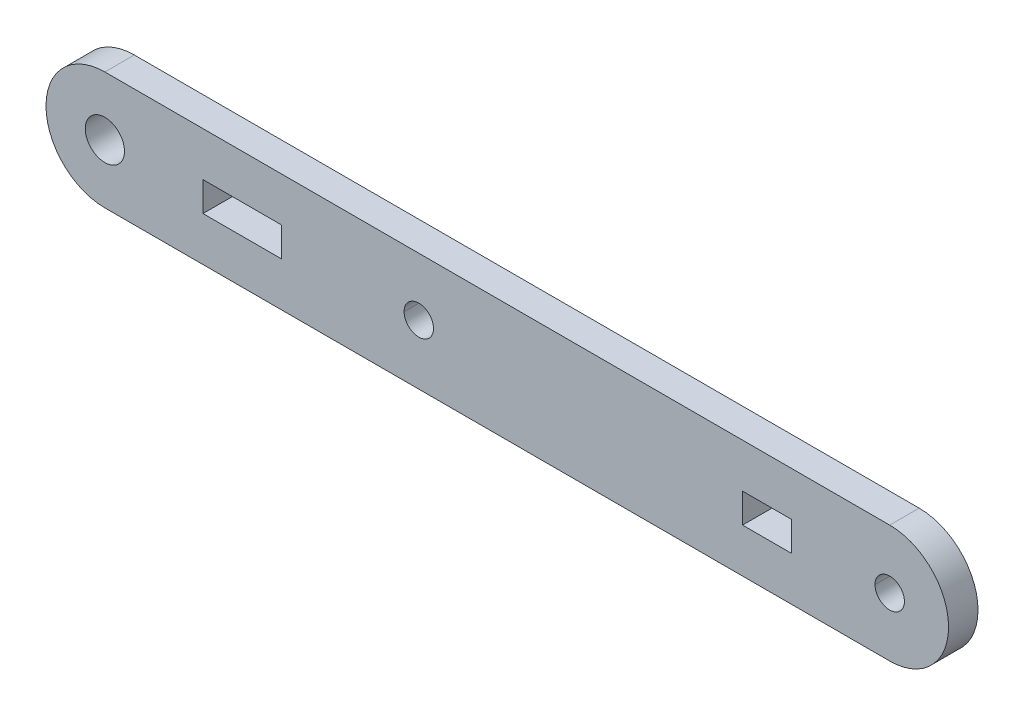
ISO-10303-21;
HEADER;
FILE_DESCRIPTION(('STEP AP214'),'2;1');
FILE_NAME('part.step','',(''),(''),'','','');
FILE_SCHEMA(('AUTOMOTIVE_DESIGN { 1 0 10303 214 1 1 1 1 }'));
ENDSEC;
DATA;
#1=APPLICATION_CONTEXT('core data for automotive mechanical design processes');
#2=APPLICATION_PROTOCOL_DEFINITION('international standard','automotive_design',2000,#1);
#3=PRODUCT_CONTEXT('',#1,'mechanical');
#4=PRODUCT('Part','Part','',(#3));
#5=PRODUCT_RELATED_PRODUCT_CATEGORY('part','',(#4));
#6=PRODUCT_DEFINITION_FORMATION('','',#4);
#7=PRODUCT_DEFINITION_CONTEXT('part definition',#1,'design');
#8=PRODUCT_DEFINITION('design','',#6,#7);
#9=PRODUCT_DEFINITION_SHAPE('','',#8);
#10=(LENGTH_UNIT() NAMED_UNIT(*) SI_UNIT(.MILLI.,.METRE.));
#11=(NAMED_UNIT(*) PLANE_ANGLE_UNIT() SI_UNIT($,.RADIAN.));
#12=(NAMED_UNIT(*) SI_UNIT($,.STERADIAN.) SOLID_ANGLE_UNIT());
#13=UNCERTAINTY_MEASURE_WITH_UNIT(LENGTH_MEASURE(1.E-05),#10,'distance_accuracy_value','');
#14=(GEOMETRIC_REPRESENTATION_CONTEXT(3) GLOBAL_UNCERTAINTY_ASSIGNED_CONTEXT((#13)) GLOBAL_UNIT_ASSIGNED_CONTEXT((#10,
#11,#12)) REPRESENTATION_CONTEXT('',''));
#15=CARTESIAN_POINT('',(0.,0.,0.));
#16=DIRECTION('',(0.,0.,1.));
#17=DIRECTION('',(1.,0.,0.));
#18=AXIS2_PLACEMENT_3D('',#15,#16,#17);
#19=CARTESIAN_POINT('',(-62.9738368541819,-40.5517486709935,0.));
#20=DIRECTION('',(0.,0.,1.));
#21=DIRECTION('',(1.,0.,0.));
#22=AXIS2_PLACEMENT_3D('',#19,#20,#21);
#23=PLANE('',#22);
#24=CARTESIAN_POINT('',(-62.9738368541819,-40.5517486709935,0.));
#25=DIRECTION('',(0.,0.,1.));
#26=DIRECTION('',(1.,0.,0.));
#27=AXIS2_PLACEMENT_3D('',#24,#25,#26);
#28=CIRCLE('',#27,2.);
#29=CARTESIAN_POINT('',(-60.9738368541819,-40.5517486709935,0.));
#30=VERTEX_POINT('',#29);
#31=EDGE_CURVE('E214',#30,#30,#28,.T.);
#32=ORIENTED_EDGE('',*,*,#31,.T.);
#33=EDGE_LOOP('',(#32));
#34=FACE_BOUND('',#33,.T.);
#35=DIRECTION('',(1.,0.,0.));
#36=VECTOR('',#35,1.);
#37=CARTESIAN_POINT('',(2.0261631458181,-42.0517486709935,0.));
#38=LINE('',#37,#36);
#39=CARTESIAN_POINT('',(7.02616314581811,-42.0517486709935,0.));
#40=VERTEX_POINT('',#39);
#41=CARTESIAN_POINT('',(2.0261631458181,-42.0517486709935,0.));
#42=VERTEX_POINT('',#41);
#43=EDGE_CURVE('E246',#40,#42,#38,.F.);
#44=ORIENTED_EDGE('',*,*,#43,.F.);
#45=DIRECTION('',(0.,1.,0.));
#46=VECTOR('',#45,1.);
#47=CARTESIAN_POINT('',(7.0261631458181,-42.0517486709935,0.));
#48=LINE('',#47,#46);
#49=CARTESIAN_POINT('',(7.02616314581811,-39.0517486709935,0.));
#50=VERTEX_POINT('',#49);
#51=EDGE_CURVE('E261',#50,#40,#48,.F.);
#52=ORIENTED_EDGE('',*,*,#51,.F.);
#53=DIRECTION('',(1.,0.,0.));
#54=VECTOR('',#53,1.);
#55=CARTESIAN_POINT('',(2.0261631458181,-39.0517486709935,0.));
#56=LINE('',#55,#54);
#57=CARTESIAN_POINT('',(2.0261631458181,-39.0517486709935,0.));
#58=VERTEX_POINT('',#57);
#59=EDGE_CURVE('E256',#58,#50,#56,.T.);
#60=ORIENTED_EDGE('',*,*,#59,.F.);
#61=DIRECTION('',(0.,1.,0.));
#62=VECTOR('',#61,1.);
#63=CARTESIAN_POINT('',(2.0261631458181,-42.0517486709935,0.));
#64=LINE('',#63,#62);
#65=EDGE_CURVE('E250',#42,#58,#64,.T.);
#66=ORIENTED_EDGE('',*,*,#65,.F.);
#67=EDGE_LOOP('',(#44,#52,#60,#66));
#68=FACE_BOUND('',#67,.T.);
#69=CARTESIAN_POINT('',(17.0261631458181,-40.5517486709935,0.));
#70=DIRECTION('',(0.,0.,-1.));
#71=DIRECTION('',(-1.,0.,0.));
#72=AXIS2_PLACEMENT_3D('',#69,#70,#71);
#73=CIRCLE('',#72,1.5);
#74=CARTESIAN_POINT('',(18.5261631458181,-40.5517486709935,0.));
#75=VERTEX_POINT('',#74);
#76=CARTESIAN_POINT('',(15.5261631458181,-40.5517486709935,0.));
#77=VERTEX_POINT('',#76);
#78=EDGE_CURVE('E179',#75,#77,#73,.F.);
#79=ORIENTED_EDGE('',*,*,#78,.T.);
#80=CARTESIAN_POINT('',(17.0261631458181,-40.5517486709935,0.));
#81=DIRECTION('',(0.,0.,-1.));
#82=DIRECTION('',(-1.,0.,0.));
#83=AXIS2_PLACEMENT_3D('',#80,#81,#82);
#84=CIRCLE('',#83,1.5);
#85=EDGE_CURVE('E177',#77,#75,#84,.F.);
#86=ORIENTED_EDGE('',*,*,#85,.T.);
#87=EDGE_LOOP('',(#79,#86));
#88=FACE_BOUND('',#87,.T.);
#89=DIRECTION('',(1.,0.,0.));
#90=VECTOR('',#89,1.);
#91=CARTESIAN_POINT('',(-62.9738368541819,-34.5517486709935,0.));
#92=LINE('',#91,#90);
#93=CARTESIAN_POINT('',(-62.9738368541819,-34.5517486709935,0.));
#94=VERTEX_POINT('',#93);
#95=CARTESIAN_POINT('',(17.0261631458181,-34.5517486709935,0.));
#96=VERTEX_POINT('',#95);
#97=EDGE_CURVE('E180',#94,#96,#92,.T.);
#98=ORIENTED_EDGE('',*,*,#97,.T.);
#99=CARTESIAN_POINT('',(17.0261631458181,-40.5517486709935,0.));
#100=DIRECTION('',(0.,0.,-1.));
#101=DIRECTION('',(-1.,0.,0.));
#102=AXIS2_PLACEMENT_3D('',#99,#100,#101);
#103=CIRCLE('',#102,6.);
#104=CARTESIAN_POINT('',(17.0261631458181,-46.5517486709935,0.));
#105=VERTEX_POINT('',#104);
#106=EDGE_CURVE('E173',#105,#96,#103,.F.);
#107=ORIENTED_EDGE('',*,*,#106,.F.);
#108=DIRECTION('',(1.,0.,0.));
#109=VECTOR('',#108,1.);
#110=CARTESIAN_POINT('',(-62.9738368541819,-46.5517486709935,0.));
#111=LINE('',#110,#109);
#112=CARTESIAN_POINT('',(-62.9738368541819,-46.5517486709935,0.));
#113=VERTEX_POINT('',#112);
#114=EDGE_CURVE('E176',#105,#113,#111,.F.);
#115=ORIENTED_EDGE('',*,*,#114,.T.);
#116=CARTESIAN_POINT('',(-62.9738368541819,-40.5517486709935,0.));
#117=DIRECTION('',(0.,0.,-1.));
#118=DIRECTION('',(-1.,0.,0.));
#119=AXIS2_PLACEMENT_3D('',#116,#117,#118);
#120=CIRCLE('',#119,6.00000000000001);
#121=CARTESIAN_POINT('',(-68.9738368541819,-40.5517486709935,0.));
#122=VERTEX_POINT('',#121);
#123=EDGE_CURVE('E170',#122,#113,#120,.F.);
#124=ORIENTED_EDGE('',*,*,#123,.F.);
#125=CARTESIAN_POINT('',(-62.9738368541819,-40.5517486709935,0.));
#126=DIRECTION('',(0.,0.,-1.));
#127=DIRECTION('',(-1.,0.,0.));
#128=AXIS2_PLACEMENT_3D('',#125,#126,#127);
#129=CIRCLE('',#128,6.00000000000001);
#130=EDGE_CURVE('E162',#94,#122,#129,.F.);
#131=ORIENTED_EDGE('',*,*,#130,.F.);
#132=EDGE_LOOP('',(#98,#107,#115,#124,#131));
#133=FACE_BOUND('',#132,.T.);
#134=CARTESIAN_POINT('',(-30.9738368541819,-40.4576031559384,0.));
#135=DIRECTION('',(0.,0.,-1.));
#136=DIRECTION('',(-1.,0.,0.));
#137=AXIS2_PLACEMENT_3D('',#134,#135,#136);
#138=CIRCLE('',#137,1.5);
#139=CARTESIAN_POINT('',(-29.4738368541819,-40.4576031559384,0.));
#140=VERTEX_POINT('',#139);
#141=CARTESIAN_POINT('',(-32.4738368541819,-40.4576031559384,0.));
#142=VERTEX_POINT('',#141);
#143=EDGE_CURVE('E147',#140,#142,#138,.F.);
#144=ORIENTED_EDGE('',*,*,#143,.T.);
#145=CARTESIAN_POINT('',(-30.9738368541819,-40.4576031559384,0.));
#146=DIRECTION('',(0.,0.,-1.));
#147=DIRECTION('',(-1.,0.,0.));
#148=AXIS2_PLACEMENT_3D('',#145,#146,#147);
#149=CIRCLE('',#148,1.5);
#150=EDGE_CURVE('E33',#142,#140,#149,.F.);
#151=ORIENTED_EDGE('',*,*,#150,.T.);
#152=EDGE_LOOP('',(#144,#151));
#153=FACE_BOUND('',#152,.T.);
#154=DIRECTION('',(1.,0.,0.));
#155=VECTOR('',#154,1.);
#156=CARTESIAN_POINT('',(-52.9738368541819,-42.0517486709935,0.));
#157=LINE('',#156,#155);
#158=CARTESIAN_POINT('',(-44.9738368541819,-42.0517486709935,0.));
#159=VERTEX_POINT('',#158);
#160=CARTESIAN_POINT('',(-52.9738368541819,-42.0517486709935,0.));
#161=VERTEX_POINT('',#160);
#162=EDGE_CURVE('E210',#159,#161,#157,.F.);
#163=ORIENTED_EDGE('',*,*,#162,.F.);
#164=DIRECTION('',(0.,1.,0.));
#165=VECTOR('',#164,1.);
#166=CARTESIAN_POINT('',(-44.9738368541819,-42.0517486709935,0.));
#167=LINE('',#166,#165);
#168=CARTESIAN_POINT('',(-44.9738368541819,-39.0517486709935,0.));
#169=VERTEX_POINT('',#168);
#170=EDGE_CURVE('E226',#169,#159,#167,.F.);
#171=ORIENTED_EDGE('',*,*,#170,.F.);
#172=DIRECTION('',(1.,0.,0.));
#173=VECTOR('',#172,1.);
#174=CARTESIAN_POINT('',(-52.9738368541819,-39.0517486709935,0.));
#175=LINE('',#174,#173);
#176=CARTESIAN_POINT('',(-52.9738368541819,-39.0517486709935,0.));
#177=VERTEX_POINT('',#176);
#178=EDGE_CURVE('E220',#177,#169,#175,.T.);
#179=ORIENTED_EDGE('',*,*,#178,.F.);
#180=DIRECTION('',(0.,1.,0.));
#181=VECTOR('',#180,1.);
#182=CARTESIAN_POINT('',(-52.9738368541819,-42.0517486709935,0.));
#183=LINE('',#182,#181);
#184=EDGE_CURVE('E213',#161,#177,#183,.T.);
#185=ORIENTED_EDGE('',*,*,#184,.F.);
#186=EDGE_LOOP('',(#163,#171,#179,#185));
#187=FACE_BOUND('',#186,.T.);
#188=ADVANCED_FACE('F30',(#34,#68,#88,#133,#153,#187),#23,.F.);
#189=CARTESIAN_POINT('',(-52.9738368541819,-42.0517486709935,3.));
#190=DIRECTION('',(0.,1.,0.));
#191=DIRECTION('',(0.,0.,1.));
#192=AXIS2_PLACEMENT_3D('',#189,#190,#191);
#193=PLANE('',#192);
#194=DIRECTION('',(1.,0.,0.));
#195=VECTOR('',#194,1.);
#196=CARTESIAN_POINT('',(-62.9738368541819,-42.0517486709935,3.));
#197=LINE('',#196,#195);
#198=CARTESIAN_POINT('',(-44.9738368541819,-42.0517486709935,3.));
#199=VERTEX_POINT('',#198);
#200=CARTESIAN_POINT('',(-52.9738368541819,-42.0517486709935,3.));
#201=VERTEX_POINT('',#200);
#202=EDGE_CURVE('E268',#199,#201,#197,.F.);
#203=ORIENTED_EDGE('',*,*,#202,.F.);
#204=DIRECTION('',(0.,0.,1.));
#205=VECTOR('',#204,1.);
#206=CARTESIAN_POINT('',(-44.9738368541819,-42.0517486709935,3.));
#207=LINE('',#206,#205);
#208=EDGE_CURVE('E229',#159,#199,#207,.T.);
#209=ORIENTED_EDGE('',*,*,#208,.F.);
#210=ORIENTED_EDGE('',*,*,#162,.T.);
#211=DIRECTION('',(0.,0.,-1.));
#212=VECTOR('',#211,1.);
#213=CARTESIAN_POINT('',(-52.9738368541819,-42.0517486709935,3.));
#214=LINE('',#213,#212);
#215=EDGE_CURVE('E217',#201,#161,#214,.T.);
#216=ORIENTED_EDGE('',*,*,#215,.F.);
#217=EDGE_LOOP('',(#203,#209,#210,#216));
#218=FACE_BOUND('',#217,.T.);
#219=ADVANCED_FACE('F323',(#218),#193,.T.);
#220=CARTESIAN_POINT('',(-52.9738368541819,-42.0517486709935,3.));
#221=DIRECTION('',(1.,0.,0.));
#222=DIRECTION('',(0.,0.,-1.));
#223=AXIS2_PLACEMENT_3D('',#220,#221,#222);
#224=PLANE('',#223);
#225=DIRECTION('',(0.,1.,0.));
#226=VECTOR('',#225,1.);
#227=CARTESIAN_POINT('',(-52.9738368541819,-40.5517486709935,3.));
#228=LINE('',#227,#226);
#229=CARTESIAN_POINT('',(-52.9738368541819,-39.0517486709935,3.));
#230=VERTEX_POINT('',#229);
#231=EDGE_CURVE('E271',#201,#230,#228,.T.);
#232=ORIENTED_EDGE('',*,*,#231,.F.);
#233=ORIENTED_EDGE('',*,*,#215,.T.);
#234=ORIENTED_EDGE('',*,*,#184,.T.);
#235=DIRECTION('',(0.,0.,-1.));
#236=VECTOR('',#235,1.);
#237=CARTESIAN_POINT('',(-52.9738368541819,-39.0517486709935,3.));
#238=LINE('',#237,#236);
#239=EDGE_CURVE('E223',#230,#177,#238,.T.);
#240=ORIENTED_EDGE('',*,*,#239,.F.);
#241=EDGE_LOOP('',(#232,#233,#234,#240));
#242=FACE_BOUND('',#241,.T.);
#243=ADVANCED_FACE('F325',(#242),#224,.T.);
#244=CARTESIAN_POINT('',(-52.9738368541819,-39.0517486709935,3.));
#245=DIRECTION('',(0.,-1.,0.));
#246=DIRECTION('',(0.,0.,-1.));
#247=AXIS2_PLACEMENT_3D('',#244,#245,#246);
#248=PLANE('',#247);
#249=DIRECTION('',(1.,0.,0.));
#250=VECTOR('',#249,1.);
#251=CARTESIAN_POINT('',(-62.9738368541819,-39.0517486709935,3.));
#252=LINE('',#251,#250);
#253=CARTESIAN_POINT('',(-44.9738368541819,-39.0517486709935,3.));
#254=VERTEX_POINT('',#253);
#255=EDGE_CURVE('E274',#230,#254,#252,.T.);
#256=ORIENTED_EDGE('',*,*,#255,.F.);
#257=ORIENTED_EDGE('',*,*,#239,.T.);
#258=ORIENTED_EDGE('',*,*,#178,.T.);
#259=DIRECTION('',(0.,0.,1.));
#260=VECTOR('',#259,1.);
#261=CARTESIAN_POINT('',(-44.9738368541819,-39.0517486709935,3.));
#262=LINE('',#261,#260);
#263=EDGE_CURVE('E153',#254,#169,#262,.F.);
#264=ORIENTED_EDGE('',*,*,#263,.F.);
#265=EDGE_LOOP('',(#256,#257,#258,#264));
#266=FACE_BOUND('',#265,.T.);
#267=ADVANCED_FACE('F318',(#266),#248,.T.);
#268=CARTESIAN_POINT('',(-44.9738368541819,-42.0517486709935,3.));
#269=DIRECTION('',(-1.,0.,0.));
#270=DIRECTION('',(0.,0.,1.));
#271=AXIS2_PLACEMENT_3D('',#268,#269,#270);
#272=PLANE('',#271);
#273=DIRECTION('',(0.,1.,0.));
#274=VECTOR('',#273,1.);
#275=CARTESIAN_POINT('',(-44.9738368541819,-40.5517486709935,3.));
#276=LINE('',#275,#274);
#277=EDGE_CURVE('E185',#254,#199,#276,.F.);
#278=ORIENTED_EDGE('',*,*,#277,.F.);
#279=ORIENTED_EDGE('',*,*,#263,.T.);
#280=ORIENTED_EDGE('',*,*,#170,.T.);
#281=ORIENTED_EDGE('',*,*,#208,.T.);
#282=EDGE_LOOP('',(#278,#279,#280,#281));
#283=FACE_BOUND('',#282,.T.);
#284=ADVANCED_FACE('F320',(#283),#272,.T.);
#285=CARTESIAN_POINT('',(-30.9738368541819,-40.4576031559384,3.));
#286=DIRECTION('',(0.,0.,-1.));
#287=DIRECTION('',(-1.,0.,0.));
#288=AXIS2_PLACEMENT_3D('',#285,#286,#287);
#289=CYLINDRICAL_SURFACE('',#288,1.5);
#290=DIRECTION('',(0.,0.,-1.));
#291=VECTOR('',#290,1.);
#292=CARTESIAN_POINT('',(-29.4738368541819,-40.4576031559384,3.));
#293=LINE('',#292,#291);
#294=CARTESIAN_POINT('',(-29.4738368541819,-40.4576031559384,3.));
#295=VERTEX_POINT('',#294);
#296=EDGE_CURVE('E155',#295,#140,#293,.T.);
#297=ORIENTED_EDGE('',*,*,#296,.T.);
#298=ORIENTED_EDGE('',*,*,#150,.F.);
#299=DIRECTION('',(0.,0.,-1.));
#300=VECTOR('',#299,1.);
#301=CARTESIAN_POINT('',(-32.4738368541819,-40.4576031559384,3.));
#302=LINE('',#301,#300);
#303=CARTESIAN_POINT('',(-32.4738368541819,-40.4576031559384,3.));
#304=VERTEX_POINT('',#303);
#305=EDGE_CURVE('E163',#142,#304,#302,.F.);
#306=ORIENTED_EDGE('',*,*,#305,.T.);
#307=CARTESIAN_POINT('',(-30.9738368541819,-40.4576031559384,3.));
#308=DIRECTION('',(0.,0.,-1.));
#309=DIRECTION('',(-1.,0.,0.));
#310=AXIS2_PLACEMENT_3D('',#307,#308,#309);
#311=CIRCLE('',#310,1.5);
#312=EDGE_CURVE('E158',#295,#304,#311,.T.);
#313=ORIENTED_EDGE('',*,*,#312,.F.);
#314=EDGE_LOOP('',(#297,#298,#306,#313));
#315=FACE_BOUND('',#314,.T.);
#316=ADVANCED_FACE('F156',(#315),#289,.F.);
#317=CARTESIAN_POINT('',(-30.9738368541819,-40.4576031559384,3.));
#318=DIRECTION('',(0.,0.,-1.));
#319=DIRECTION('',(-1.,0.,0.));
#320=AXIS2_PLACEMENT_3D('',#317,#318,#319);
#321=CYLINDRICAL_SURFACE('',#320,1.5);
#322=CARTESIAN_POINT('',(-30.9738368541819,-40.4576031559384,3.));
#323=DIRECTION('',(0.,0.,-1.));
#324=DIRECTION('',(-1.,0.,0.));
#325=AXIS2_PLACEMENT_3D('',#322,#323,#324);
#326=CIRCLE('',#325,1.5);
#327=EDGE_CURVE('E184',#304,#295,#326,.T.);
#328=ORIENTED_EDGE('',*,*,#327,.F.);
#329=ORIENTED_EDGE('',*,*,#305,.F.);
#330=ORIENTED_EDGE('',*,*,#143,.F.);
#331=ORIENTED_EDGE('',*,*,#296,.F.);
#332=EDGE_LOOP('',(#328,#329,#330,#331));
#333=FACE_BOUND('',#332,.T.);
#334=ADVANCED_FACE('F165',(#333),#321,.F.);
#335=CARTESIAN_POINT('',(-62.9738368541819,-40.5517486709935,3.));
#336=DIRECTION('',(0.,0.,-1.));
#337=DIRECTION('',(-1.,0.,0.));
#338=AXIS2_PLACEMENT_3D('',#335,#336,#337);
#339=CYLINDRICAL_SURFACE('',#338,6.00000000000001);
#340=DIRECTION('',(0.,0.,-1.));
#341=VECTOR('',#340,1.);
#342=CARTESIAN_POINT('',(-62.9738368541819,-34.5517486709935,3.));
#343=LINE('',#342,#341);
#344=CARTESIAN_POINT('',(-62.9738368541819,-34.5517486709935,3.));
#345=VERTEX_POINT('',#344);
#346=EDGE_CURVE('E209',#345,#94,#343,.T.);
#347=ORIENTED_EDGE('',*,*,#346,.T.);
#348=ORIENTED_EDGE('',*,*,#130,.T.);
#349=DIRECTION('',(0.,0.,-1.));
#350=VECTOR('',#349,1.);
#351=CARTESIAN_POINT('',(-68.9738368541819,-40.5517486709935,3.));
#352=LINE('',#351,#350);
#353=CARTESIAN_POINT('',(-68.9738368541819,-40.5517486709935,3.));
#354=VERTEX_POINT('',#353);
#355=EDGE_CURVE('E169',#354,#122,#352,.T.);
#356=ORIENTED_EDGE('',*,*,#355,.F.);
#357=CARTESIAN_POINT('',(-62.9738368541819,-40.5517486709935,3.));
#358=DIRECTION('',(0.,0.,-1.));
#359=DIRECTION('',(-1.,0.,0.));
#360=AXIS2_PLACEMENT_3D('',#357,#358,#359);
#361=CIRCLE('',#360,6.00000000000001);
#362=EDGE_CURVE('E187',#345,#354,#361,.F.);
#363=ORIENTED_EDGE('',*,*,#362,.F.);
#364=EDGE_LOOP('',(#347,#348,#356,#363));
#365=FACE_BOUND('',#364,.T.);
#366=ADVANCED_FACE('F343',(#365),#339,.T.);
#367=CARTESIAN_POINT('',(-62.9738368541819,-40.5517486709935,3.));
#368=DIRECTION('',(0.,0.,-1.));
#369=DIRECTION('',(-1.,0.,0.));
#370=AXIS2_PLACEMENT_3D('',#367,#368,#369);
#371=CYLINDRICAL_SURFACE('',#370,6.00000000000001);
#372=ORIENTED_EDGE('',*,*,#123,.T.);
#373=DIRECTION('',(0.,0.,1.));
#374=VECTOR('',#373,1.);
#375=CARTESIAN_POINT('',(-62.9738368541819,-46.5517486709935,3.));
#376=LINE('',#375,#374);
#377=CARTESIAN_POINT('',(-62.9738368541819,-46.5517486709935,3.));
#378=VERTEX_POINT('',#377);
#379=EDGE_CURVE('E172',#113,#378,#376,.T.);
#380=ORIENTED_EDGE('',*,*,#379,.T.);
#381=CARTESIAN_POINT('',(-62.9738368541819,-40.5517486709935,3.));
#382=DIRECTION('',(0.,0.,-1.));
#383=DIRECTION('',(-1.,0.,0.));
#384=AXIS2_PLACEMENT_3D('',#381,#382,#383);
#385=CIRCLE('',#384,6.00000000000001);
#386=EDGE_CURVE('E190',#354,#378,#385,.F.);
#387=ORIENTED_EDGE('',*,*,#386,.F.);
#388=ORIENTED_EDGE('',*,*,#355,.T.);
#389=EDGE_LOOP('',(#372,#380,#387,#388));
#390=FACE_BOUND('',#389,.T.);
#391=ADVANCED_FACE('F346',(#390),#371,.T.);
#392=CARTESIAN_POINT('',(-62.9738368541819,-46.5517486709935,3.));
#393=DIRECTION('',(0.,1.,0.));
#394=DIRECTION('',(0.,0.,1.));
#395=AXIS2_PLACEMENT_3D('',#392,#393,#394);
#396=PLANE('',#395);
#397=DIRECTION('',(0.,0.,-1.));
#398=VECTOR('',#397,1.);
#399=CARTESIAN_POINT('',(17.0261631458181,-46.5517486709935,3.));
#400=LINE('',#399,#398);
#401=CARTESIAN_POINT('',(17.0261631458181,-46.5517486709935,3.));
#402=VERTEX_POINT('',#401);
#403=EDGE_CURVE('E175',#402,#105,#400,.T.);
#404=ORIENTED_EDGE('',*,*,#403,.F.);
#405=DIRECTION('',(1.,0.,0.));
#406=VECTOR('',#405,1.);
#407=CARTESIAN_POINT('',(-62.9738368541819,-46.5517486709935,3.));
#408=LINE('',#407,#406);
#409=EDGE_CURVE('E193',#378,#402,#408,.T.);
#410=ORIENTED_EDGE('',*,*,#409,.F.);
#411=ORIENTED_EDGE('',*,*,#379,.F.);
#412=ORIENTED_EDGE('',*,*,#114,.F.);
#413=EDGE_LOOP('',(#404,#410,#411,#412));
#414=FACE_BOUND('',#413,.T.);
#415=ADVANCED_FACE('F350',(#414),#396,.F.);
#416=CARTESIAN_POINT('',(17.0261631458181,-40.5517486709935,3.));
#417=DIRECTION('',(0.,0.,-1.));
#418=DIRECTION('',(-1.,0.,0.));
#419=AXIS2_PLACEMENT_3D('',#416,#417,#418);
#420=CYLINDRICAL_SURFACE('',#419,6.);
#421=CARTESIAN_POINT('',(17.0261631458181,-40.5517486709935,3.));
#422=DIRECTION('',(0.,0.,-1.));
#423=DIRECTION('',(-1.,0.,0.));
#424=AXIS2_PLACEMENT_3D('',#421,#422,#423);
#425=CIRCLE('',#424,6.);
#426=CARTESIAN_POINT('',(17.0261631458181,-34.5517486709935,3.));
#427=VERTEX_POINT('',#426);
#428=EDGE_CURVE('E194',#402,#427,#425,.F.);
#429=ORIENTED_EDGE('',*,*,#428,.F.);
#430=ORIENTED_EDGE('',*,*,#403,.T.);
#431=ORIENTED_EDGE('',*,*,#106,.T.);
#432=DIRECTION('',(0.,0.,-1.));
#433=VECTOR('',#432,1.);
#434=CARTESIAN_POINT('',(17.0261631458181,-34.5517486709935,3.));
#435=LINE('',#434,#433);
#436=EDGE_CURVE('E239',#96,#427,#435,.F.);
#437=ORIENTED_EDGE('',*,*,#436,.T.);
#438=EDGE_LOOP('',(#429,#430,#431,#437));
#439=FACE_BOUND('',#438,.T.);
#440=ADVANCED_FACE('F354',(#439),#420,.T.);
#441=CARTESIAN_POINT('',(-62.9738368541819,-34.5517486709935,3.));
#442=DIRECTION('',(0.,-1.,0.));
#443=DIRECTION('',(0.,0.,-1.));
#444=AXIS2_PLACEMENT_3D('',#441,#442,#443);
#445=PLANE('',#444);
#446=ORIENTED_EDGE('',*,*,#346,.F.);
#447=DIRECTION('',(1.,0.,0.));
#448=VECTOR('',#447,1.);
#449=CARTESIAN_POINT('',(-62.9738368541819,-34.5517486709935,3.));
#450=LINE('',#449,#448);
#451=EDGE_CURVE('E197',#427,#345,#450,.F.);
#452=ORIENTED_EDGE('',*,*,#451,.F.);
#453=ORIENTED_EDGE('',*,*,#436,.F.);
#454=ORIENTED_EDGE('',*,*,#97,.F.);
#455=EDGE_LOOP('',(#446,#452,#453,#454));
#456=FACE_BOUND('',#455,.T.);
#457=ADVANCED_FACE('F358',(#456),#445,.F.);
#458=CARTESIAN_POINT('',(17.0261631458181,-40.5517486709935,3.));
#459=DIRECTION('',(0.,0.,-1.));
#460=DIRECTION('',(-1.,0.,0.));
#461=AXIS2_PLACEMENT_3D('',#458,#459,#460);
#462=CYLINDRICAL_SURFACE('',#461,1.5);
#463=DIRECTION('',(0.,0.,-1.));
#464=VECTOR('',#463,1.);
#465=CARTESIAN_POINT('',(18.5261631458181,-40.5517486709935,3.));
#466=LINE('',#465,#464);
#467=CARTESIAN_POINT('',(18.5261631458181,-40.5517486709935,3.));
#468=VERTEX_POINT('',#467);
#469=EDGE_CURVE('E243',#468,#75,#466,.T.);
#470=ORIENTED_EDGE('',*,*,#469,.T.);
#471=ORIENTED_EDGE('',*,*,#85,.F.);
#472=DIRECTION('',(0.,0.,-1.));
#473=VECTOR('',#472,1.);
#474=CARTESIAN_POINT('',(15.5261631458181,-40.5517486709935,3.));
#475=LINE('',#474,#473);
#476=CARTESIAN_POINT('',(15.5261631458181,-40.5517486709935,3.));
#477=VERTEX_POINT('',#476);
#478=EDGE_CURVE('E182',#77,#477,#475,.F.);
#479=ORIENTED_EDGE('',*,*,#478,.T.);
#480=CARTESIAN_POINT('',(17.0261631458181,-40.5517486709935,3.));
#481=DIRECTION('',(0.,0.,-1.));
#482=DIRECTION('',(-1.,0.,0.));
#483=AXIS2_PLACEMENT_3D('',#480,#481,#482);
#484=CIRCLE('',#483,1.5);
#485=EDGE_CURVE('E198',#468,#477,#484,.T.);
#486=ORIENTED_EDGE('',*,*,#485,.F.);
#487=EDGE_LOOP('',(#470,#471,#479,#486));
#488=FACE_BOUND('',#487,.T.);
#489=ADVANCED_FACE('F362',(#488),#462,.F.);
#490=CARTESIAN_POINT('',(17.0261631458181,-40.5517486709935,3.));
#491=DIRECTION('',(0.,0.,-1.));
#492=DIRECTION('',(-1.,0.,0.));
#493=AXIS2_PLACEMENT_3D('',#490,#491,#492);
#494=CYLINDRICAL_SURFACE('',#493,1.5);
#495=CARTESIAN_POINT('',(17.0261631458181,-40.5517486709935,3.));
#496=DIRECTION('',(0.,0.,-1.));
#497=DIRECTION('',(-1.,0.,0.));
#498=AXIS2_PLACEMENT_3D('',#495,#496,#497);
#499=CIRCLE('',#498,1.5);
#500=EDGE_CURVE('E201',#477,#468,#499,.T.);
#501=ORIENTED_EDGE('',*,*,#500,.F.);
#502=ORIENTED_EDGE('',*,*,#478,.F.);
#503=ORIENTED_EDGE('',*,*,#78,.F.);
#504=ORIENTED_EDGE('',*,*,#469,.F.);
#505=EDGE_LOOP('',(#501,#502,#503,#504));
#506=FACE_BOUND('',#505,.T.);
#507=ADVANCED_FACE('F366',(#506),#494,.F.);
#508=CARTESIAN_POINT('',(2.0261631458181,-42.0517486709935,3.));
#509=DIRECTION('',(0.,1.,0.));
#510=DIRECTION('',(0.,0.,1.));
#511=AXIS2_PLACEMENT_3D('',#508,#509,#510);
#512=PLANE('',#511);
#513=DIRECTION('',(1.,0.,0.));
#514=VECTOR('',#513,1.);
#515=CARTESIAN_POINT('',(-62.9738368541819,-42.0517486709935,3.));
#516=LINE('',#515,#514);
#517=CARTESIAN_POINT('',(7.0261631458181,-42.0517486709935,3.));
#518=VERTEX_POINT('',#517);
#519=CARTESIAN_POINT('',(2.0261631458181,-42.0517486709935,3.));
#520=VERTEX_POINT('',#519);
#521=EDGE_CURVE('E204',#518,#520,#516,.F.);
#522=ORIENTED_EDGE('',*,*,#521,.F.);
#523=DIRECTION('',(0.,0.,1.));
#524=VECTOR('',#523,1.);
#525=CARTESIAN_POINT('',(7.0261631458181,-42.0517486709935,3.));
#526=LINE('',#525,#524);
#527=EDGE_CURVE('E264',#40,#518,#526,.T.);
#528=ORIENTED_EDGE('',*,*,#527,.F.);
#529=ORIENTED_EDGE('',*,*,#43,.T.);
#530=DIRECTION('',(0.,0.,-1.));
#531=VECTOR('',#530,1.);
#532=CARTESIAN_POINT('',(2.0261631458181,-42.0517486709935,3.));
#533=LINE('',#532,#531);
#534=EDGE_CURVE('E253',#520,#42,#533,.T.);
#535=ORIENTED_EDGE('',*,*,#534,.F.);
#536=EDGE_LOOP('',(#522,#528,#529,#535));
#537=FACE_BOUND('',#536,.T.);
#538=ADVANCED_FACE('F370',(#537),#512,.T.);
#539=CARTESIAN_POINT('',(2.0261631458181,-42.0517486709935,3.));
#540=DIRECTION('',(1.,0.,0.));
#541=DIRECTION('',(0.,0.,-1.));
#542=AXIS2_PLACEMENT_3D('',#539,#540,#541);
#543=PLANE('',#542);
#544=DIRECTION('',(0.,1.,0.));
#545=VECTOR('',#544,1.);
#546=CARTESIAN_POINT('',(2.02616314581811,-40.5517486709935,3.));
#547=LINE('',#546,#545);
#548=CARTESIAN_POINT('',(2.0261631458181,-39.0517486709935,3.));
#549=VERTEX_POINT('',#548);
#550=EDGE_CURVE('E285',#520,#549,#547,.T.);
#551=ORIENTED_EDGE('',*,*,#550,.F.);
#552=ORIENTED_EDGE('',*,*,#534,.T.);
#553=ORIENTED_EDGE('',*,*,#65,.T.);
#554=DIRECTION('',(0.,0.,-1.));
#555=VECTOR('',#554,1.);
#556=CARTESIAN_POINT('',(2.0261631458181,-39.0517486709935,3.));
#557=LINE('',#556,#555);
#558=EDGE_CURVE('E258',#549,#58,#557,.T.);
#559=ORIENTED_EDGE('',*,*,#558,.F.);
#560=EDGE_LOOP('',(#551,#552,#553,#559));
#561=FACE_BOUND('',#560,.T.);
#562=ADVANCED_FACE('F374',(#561),#543,.T.);
#563=CARTESIAN_POINT('',(2.0261631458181,-39.0517486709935,3.));
#564=DIRECTION('',(0.,-1.,0.));
#565=DIRECTION('',(0.,0.,-1.));
#566=AXIS2_PLACEMENT_3D('',#563,#564,#565);
#567=PLANE('',#566);
#568=DIRECTION('',(1.,0.,0.));
#569=VECTOR('',#568,1.);
#570=CARTESIAN_POINT('',(-62.9738368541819,-39.0517486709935,3.));
#571=LINE('',#570,#569);
#572=CARTESIAN_POINT('',(7.0261631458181,-39.0517486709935,3.));
#573=VERTEX_POINT('',#572);
#574=EDGE_CURVE('E39',#549,#573,#571,.T.);
#575=ORIENTED_EDGE('',*,*,#574,.F.);
#576=ORIENTED_EDGE('',*,*,#558,.T.);
#577=ORIENTED_EDGE('',*,*,#59,.T.);
#578=DIRECTION('',(0.,0.,1.));
#579=VECTOR('',#578,1.);
#580=CARTESIAN_POINT('',(7.0261631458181,-39.0517486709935,3.));
#581=LINE('',#580,#579);
#582=EDGE_CURVE('E48',#573,#50,#581,.F.);
#583=ORIENTED_EDGE('',*,*,#582,.F.);
#584=EDGE_LOOP('',(#575,#576,#577,#583));
#585=FACE_BOUND('',#584,.T.);
#586=ADVANCED_FACE('F378',(#585),#567,.T.);
#587=CARTESIAN_POINT('',(7.0261631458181,-42.0517486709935,3.));
#588=DIRECTION('',(-1.,0.,0.));
#589=DIRECTION('',(0.,0.,1.));
#590=AXIS2_PLACEMENT_3D('',#587,#588,#589);
#591=PLANE('',#590);
#592=DIRECTION('',(0.,1.,0.));
#593=VECTOR('',#592,1.);
#594=CARTESIAN_POINT('',(7.0261631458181,-40.5517486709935,3.));
#595=LINE('',#594,#593);
#596=EDGE_CURVE('E11',#573,#518,#595,.F.);
#597=ORIENTED_EDGE('',*,*,#596,.F.);
#598=ORIENTED_EDGE('',*,*,#582,.T.);
#599=ORIENTED_EDGE('',*,*,#51,.T.);
#600=ORIENTED_EDGE('',*,*,#527,.T.);
#601=EDGE_LOOP('',(#597,#598,#599,#600));
#602=FACE_BOUND('',#601,.T.);
#603=ADVANCED_FACE('F307',(#602),#591,.T.);
#604=CARTESIAN_POINT('',(-62.9738368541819,-40.5517486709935,3.));
#605=DIRECTION('',(0.,0.,1.));
#606=DIRECTION('',(1.,0.,0.));
#607=AXIS2_PLACEMENT_3D('',#604,#605,#606);
#608=PLANE('',#607);
#609=CARTESIAN_POINT('',(-62.9738368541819,-40.5517486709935,3.));
#610=DIRECTION('',(0.,0.,1.));
#611=DIRECTION('',(1.,0.,0.));
#612=AXIS2_PLACEMENT_3D('',#609,#610,#611);
#613=CIRCLE('',#612,2.);
#614=CARTESIAN_POINT('',(-60.9738368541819,-40.5517486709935,3.));
#615=VERTEX_POINT('',#614);
#616=EDGE_CURVE('E290',#615,#615,#613,.T.);
#617=ORIENTED_EDGE('',*,*,#616,.F.);
#618=EDGE_LOOP('',(#617));
#619=FACE_BOUND('',#618,.T.);
#620=ORIENTED_EDGE('',*,*,#574,.T.);
#621=ORIENTED_EDGE('',*,*,#596,.T.);
#622=ORIENTED_EDGE('',*,*,#521,.T.);
#623=ORIENTED_EDGE('',*,*,#550,.T.);
#624=EDGE_LOOP('',(#620,#621,#622,#623));
#625=FACE_BOUND('',#624,.T.);
#626=ORIENTED_EDGE('',*,*,#485,.T.);
#627=ORIENTED_EDGE('',*,*,#500,.T.);
#628=EDGE_LOOP('',(#626,#627));
#629=FACE_BOUND('',#628,.T.);
#630=ORIENTED_EDGE('',*,*,#428,.T.);
#631=ORIENTED_EDGE('',*,*,#451,.T.);
#632=ORIENTED_EDGE('',*,*,#362,.T.);
#633=ORIENTED_EDGE('',*,*,#386,.T.);
#634=ORIENTED_EDGE('',*,*,#409,.T.);
#635=EDGE_LOOP('',(#630,#631,#632,#633,#634));
#636=FACE_BOUND('',#635,.T.);
#637=ORIENTED_EDGE('',*,*,#312,.T.);
#638=ORIENTED_EDGE('',*,*,#327,.T.);
#639=EDGE_LOOP('',(#637,#638));
#640=FACE_BOUND('',#639,.T.);
#641=ORIENTED_EDGE('',*,*,#255,.T.);
#642=ORIENTED_EDGE('',*,*,#277,.T.);
#643=ORIENTED_EDGE('',*,*,#202,.T.);
#644=ORIENTED_EDGE('',*,*,#231,.T.);
#645=EDGE_LOOP('',(#641,#642,#643,#644));
#646=FACE_BOUND('',#645,.T.);
#647=ADVANCED_FACE('F301',(#619,#625,#629,#636,#640,#646),#608,.T.);
#648=CARTESIAN_POINT('',(-62.9738368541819,-40.5517486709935,0.));
#649=DIRECTION('',(0.,0.,1.));
#650=DIRECTION('',(1.,0.,0.));
#651=AXIS2_PLACEMENT_3D('',#648,#649,#650);
#652=CYLINDRICAL_SURFACE('',#651,2.);
#653=ORIENTED_EDGE('',*,*,#31,.F.);
#654=EDGE_LOOP('',(#653));
#655=FACE_BOUND('',#654,.T.);
#656=ORIENTED_EDGE('',*,*,#616,.T.);
#657=EDGE_LOOP('',(#656));
#658=FACE_BOUND('',#657,.T.);
#659=ADVANCED_FACE('F298',(#655,#658),#652,.F.);
#660=CLOSED_SHELL('',(#188,#219,#243,#267,#284,#316,#334,#366,#391,#415,#440,#457,#489,#507,
#538,#562,#586,#603,#647,#659));
#661=MANIFOLD_SOLID_BREP('B2',#660);
#662=ADVANCED_BREP_SHAPE_REPRESENTATION('',(#18,#661),#14);
#663=SHAPE_DEFINITION_REPRESENTATION(#9,#662);
ENDSEC;
END-ISO-10303-21;
